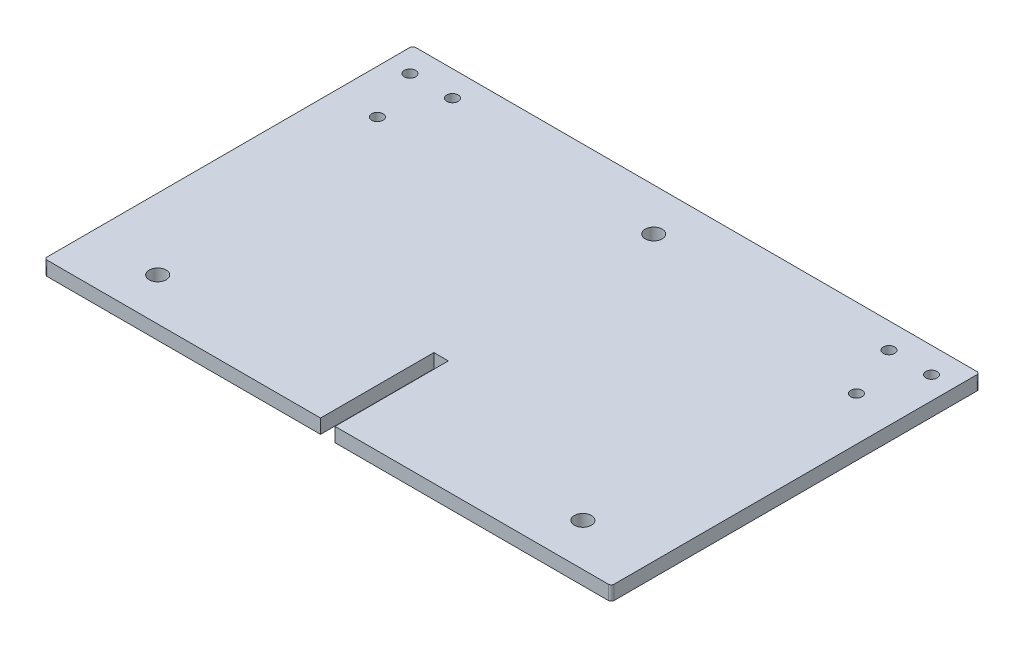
from build123d import *

# Parameters (mm, degrees)
SKETCH1_R           = 2
SKETCH1_R_2         = 3
BOSS_EXTRUDE1_DEPTH = 5
FILLET1_R           = 1


with BuildPart() as part:
    # Sketch1 → Boss-Extrude1 (new body)
    with BuildSketch(Plane(origin=(0, 0, 0), x_dir=(1, 0, 0), z_dir=(0, 1, 0))):
        Polygon((0, 0), (200, 0), (200, -130), (102.55, -130), (102.55, -90), (97.45, -90), (97.45, -130), (0, -130), align=None)
        with Locations(Location((8, -9, 0), (0, 0, 270))):
            Circle(SKETCH1_R, mode=Mode.SUBTRACT)
        with Locations(Location((23, -9, 0), (0, 0, 270))):
            Circle(SKETCH1_R, mode=Mode.SUBTRACT)
        with Locations(Location((15.5, -28, 0), (0, 0, 270))):
            Circle(SKETCH1_R, mode=Mode.SUBTRACT)
        with Locations(Location((25, -115, 0), (0, 0, 270))):
            Circle(SKETCH1_R_2, mode=Mode.SUBTRACT)
        with Locations(Location((175, -115, 0), (0, 0, 90))):
            Circle(SKETCH1_R_2, mode=Mode.SUBTRACT)
        with Locations(Location((184.5, -28, 0), (0, 0, 90))):
            Circle(SKETCH1_R, mode=Mode.SUBTRACT)
        with Locations(Location((177, -9, 0), (0, 0, 90))):
            Circle(SKETCH1_R, mode=Mode.SUBTRACT)
        with Locations(Location((192, -9, 0), (0, 0, 90))):
            Circle(SKETCH1_R, mode=Mode.SUBTRACT)
        with Locations(Location((100, -15, 0), (0, 0, 270))):
            Circle(SKETCH1_R_2, mode=Mode.SUBTRACT)
    extrude(amount=BOSS_EXTRUDE1_DEPTH)

    # Fillet1
    fillet1_edges = [part.edges().sort_by_distance(p)[0] for p in [
        (0, 2.5, 0),
        (200, 2.5, 0),
        (200, 2.5, 130),
        (0, 2.5, 130),
    ]]
    fillet(fillet1_edges, radius=FILLET1_R)


solid = part.part
